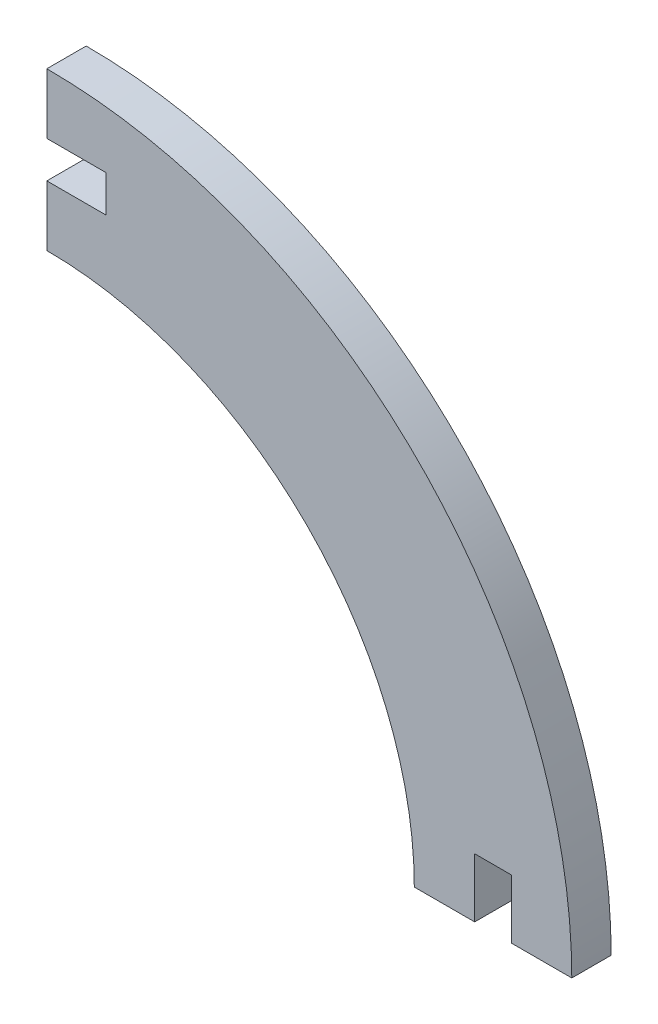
from build123d import *

# Parameters (mm, degrees)
BOSS_EXTRU_1_DEPTH = 3


with BuildPart() as part:
    # Esquisse1 → Boss.-Extru.1 (new body)
    with BuildSketch(Plane.XY):
        with BuildLine():
            Line((0, 28), (0, 32.6))
            Line((0, 32.6), (4.5, 32.6))
            Line((4.5, 32.6), (4.5, 35.4))
            Line((4.5, 35.4), (0, 35.4))
            Line((0, 35.4), (0, 40))
            ThreePointArc((0, 40), (28.284271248, 28.284271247), (40, 0))
            Line((40, 0), (35.4, 0))
            Line((35.4, 0), (35.4, 4.5))
            Line((35.4, 4.5), (32.6, 4.5))
            Line((32.6, 4.5), (32.6, 0))
            Line((32.6, 0), (28, 0))
            ThreePointArc((28, 0), (19.798989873, 19.798989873), (0, 28))
        make_face()
    extrude(amount=BOSS_EXTRU_1_DEPTH)


solid = part.part
